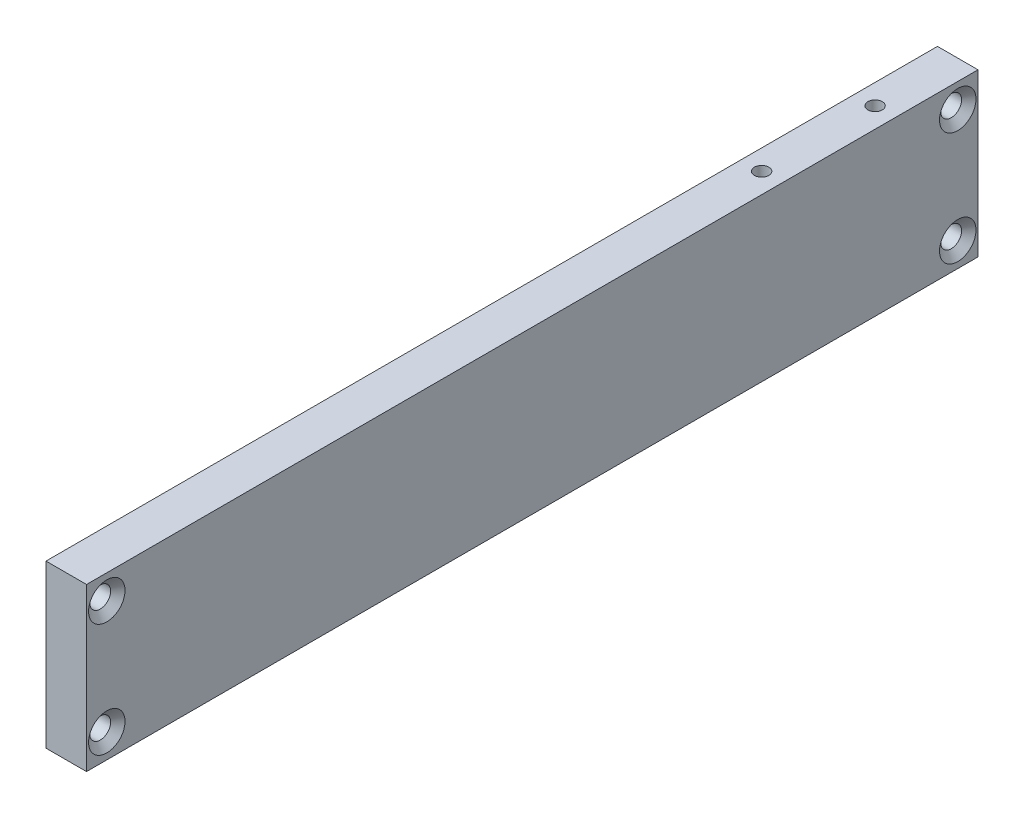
from build123d import *

# Parameters (mm, degrees)
SKETCH1_W                                         = 139.7
SKETCH1_H                                         = 25.4
EXTRUDE1_DEPTH                                    = 6.35
CSK_FOR_4_FLAT_HEAD_MACHINE_SCREW_100_D           = 3.2639
CSK_FOR_4_FLAT_HEAD_MACHINE_SCREW_100_CSINK_D     = 5.715
CSK_FOR_4_FLAT_HEAD_MACHINE_SCREW_100_CSINK_ANGLE = 100
F_4_40_TAPPED_HOLE1_D                             = 2.2606
F_4_40_TAPPED_HOLE1_DEPTH                         = 11.43
F_4_40_TAPPED_HOLE1_TIP                           = 0.679152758
F_4_40_TAPPED_HOLE1_ON_FACE_2_D                   = 2.2606
F_4_40_TAPPED_HOLE1_ON_FACE_2_DEPTH               = 11.43
F_4_40_TAPPED_HOLE1_ON_FACE_2_TIP                 = 0.679152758


with BuildPart() as part:
    # Sketch1 → Extrude1 (new body)
    with BuildSketch(Plane(origin=(0, 0, 0), x_dir=(0, 0, -1), z_dir=(1, 0, 0))):
        with Locations((0, 2.54)):
            Rectangle(SKETCH1_W, SKETCH1_H)
    extrude(amount=EXTRUDE1_DEPTH)

    # CSK for _4 Flat Head Machine Screw _100 (through all)
    with Locations(Plane(origin=(6.35, 11.43, 66.675), x_dir=(0, 0, 1), z_dir=(1, 0, 0))):
        with Locations((0, 0), (0, 17.78), (-133.35, 0), (-133.35, 17.78)):
            CounterSinkHole(CSK_FOR_4_FLAT_HEAD_MACHINE_SCREW_100_D / 2, CSK_FOR_4_FLAT_HEAD_MACHINE_SCREW_100_CSINK_D / 2, counter_sink_angle=CSK_FOR_4_FLAT_HEAD_MACHINE_SCREW_100_CSINK_ANGLE)

    # 4-40 Tapped Hole1
    with Locations(Plane(origin=(3.175, 15.24, -39.116), x_dir=(0, 0, 1), z_dir=(0, 1, 0))):
        with Locations((0, 0), (-17.78, 0)):
            Hole(F_4_40_TAPPED_HOLE1_D / 2, depth=F_4_40_TAPPED_HOLE1_DEPTH)
            with Locations((0, 0, -(F_4_40_TAPPED_HOLE1_DEPTH + F_4_40_TAPPED_HOLE1_TIP / 2))):  # 118° drill point
                Cone(0, F_4_40_TAPPED_HOLE1_D / 2, F_4_40_TAPPED_HOLE1_TIP, mode=Mode.SUBTRACT)

    # 4-40 Tapped Hole1 on face 2
    with Locations(Plane(origin=(-19.414882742, 102.4939869, 0), x_dir=(0, 0, 1), z_dir=(0, 1, 0))):
        with Locations((0, 0)):
            Hole(F_4_40_TAPPED_HOLE1_ON_FACE_2_D / 2, depth=F_4_40_TAPPED_HOLE1_ON_FACE_2_DEPTH)
            with Locations((0, 0, -(F_4_40_TAPPED_HOLE1_ON_FACE_2_DEPTH + F_4_40_TAPPED_HOLE1_ON_FACE_2_TIP / 2))):  # 118° drill point
                Cone(0, F_4_40_TAPPED_HOLE1_ON_FACE_2_D / 2, F_4_40_TAPPED_HOLE1_ON_FACE_2_TIP, mode=Mode.SUBTRACT)


solid = part.part
